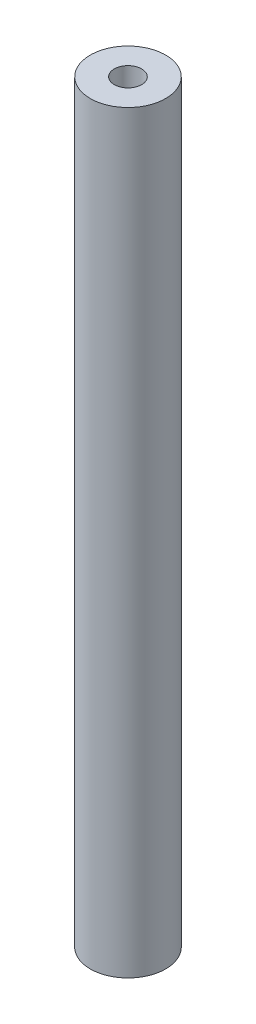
ISO-10303-21;
HEADER;
FILE_DESCRIPTION(('STEP AP214'),'2;1');
FILE_NAME('part.step','',(''),(''),'','','');
FILE_SCHEMA(('AUTOMOTIVE_DESIGN { 1 0 10303 214 1 1 1 1 }'));
ENDSEC;
DATA;
#1=APPLICATION_CONTEXT('core data for automotive mechanical design processes');
#2=APPLICATION_PROTOCOL_DEFINITION('international standard','automotive_design',2000,#1);
#3=PRODUCT_CONTEXT('',#1,'mechanical');
#4=PRODUCT('Part','Part','',(#3));
#5=PRODUCT_RELATED_PRODUCT_CATEGORY('part','',(#4));
#6=PRODUCT_DEFINITION_FORMATION('','',#4);
#7=PRODUCT_DEFINITION_CONTEXT('part definition',#1,'design');
#8=PRODUCT_DEFINITION('design','',#6,#7);
#9=PRODUCT_DEFINITION_SHAPE('','',#8);
#10=(LENGTH_UNIT() NAMED_UNIT(*) SI_UNIT(.MILLI.,.METRE.));
#11=(NAMED_UNIT(*) PLANE_ANGLE_UNIT() SI_UNIT($,.RADIAN.));
#12=(NAMED_UNIT(*) SI_UNIT($,.STERADIAN.) SOLID_ANGLE_UNIT());
#13=UNCERTAINTY_MEASURE_WITH_UNIT(LENGTH_MEASURE(1.E-05),#10,'distance_accuracy_value','');
#14=(GEOMETRIC_REPRESENTATION_CONTEXT(3) GLOBAL_UNCERTAINTY_ASSIGNED_CONTEXT((#13)) GLOBAL_UNIT_ASSIGNED_CONTEXT((#10,
#11,#12)) REPRESENTATION_CONTEXT('',''));
#15=CARTESIAN_POINT('',(0.,0.,0.));
#16=DIRECTION('',(0.,0.,1.));
#17=DIRECTION('',(1.,0.,0.));
#18=AXIS2_PLACEMENT_3D('',#15,#16,#17);
#19=CARTESIAN_POINT('',(0.,95.25,4.16333634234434E-13));
#20=DIRECTION('',(0.,-1.,0.));
#21=DIRECTION('',(0.,0.,-1.));
#22=AXIS2_PLACEMENT_3D('',#19,#20,#21);
#23=CYLINDRICAL_SURFACE('',#22,4.7625);
#24=CARTESIAN_POINT('',(0.,95.25,4.16333634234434E-13));
#25=DIRECTION('',(0.,1.,0.));
#26=DIRECTION('',(0.,0.,1.));
#27=AXIS2_PLACEMENT_3D('',#24,#25,#26);
#28=CIRCLE('',#27,4.7625);
#29=CARTESIAN_POINT('',(0.,95.25,4.76250000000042));
#30=VERTEX_POINT('',#29);
#31=EDGE_CURVE('E11',#30,#30,#28,.T.);
#32=ORIENTED_EDGE('',*,*,#31,.F.);
#33=EDGE_LOOP('',(#32));
#34=FACE_BOUND('',#33,.T.);
#35=CARTESIAN_POINT('',(0.,0.,0.));
#36=DIRECTION('',(0.,1.,0.));
#37=DIRECTION('',(0.,0.,1.));
#38=AXIS2_PLACEMENT_3D('',#35,#36,#37);
#39=CIRCLE('',#38,4.7625);
#40=CARTESIAN_POINT('',(0.,0.,4.7625));
#41=VERTEX_POINT('',#40);
#42=EDGE_CURVE('E43',#41,#41,#39,.T.);
#43=ORIENTED_EDGE('',*,*,#42,.T.);
#44=EDGE_LOOP('',(#43));
#45=FACE_BOUND('',#44,.T.);
#46=ADVANCED_FACE('F40',(#34,#45),#23,.T.);
#47=CARTESIAN_POINT('',(0.,95.25,4.16333634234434E-13));
#48=DIRECTION('',(0.,1.,0.));
#49=DIRECTION('',(0.,0.,1.));
#50=AXIS2_PLACEMENT_3D('',#47,#48,#49);
#51=PLANE('',#50);
#52=CARTESIAN_POINT('',(0.,95.25,4.16333634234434E-13));
#53=DIRECTION('',(0.,1.,0.));
#54=DIRECTION('',(0.,0.,1.));
#55=AXIS2_PLACEMENT_3D('',#52,#53,#54);
#56=CIRCLE('',#55,1.72719999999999);
#57=CARTESIAN_POINT('',(0.,95.25,1.72720000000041));
#58=VERTEX_POINT('',#57);
#59=EDGE_CURVE('E64',#58,#58,#56,.T.);
#60=ORIENTED_EDGE('',*,*,#59,.F.);
#61=EDGE_LOOP('',(#60));
#62=FACE_BOUND('',#61,.T.);
#63=ORIENTED_EDGE('',*,*,#31,.T.);
#64=EDGE_LOOP('',(#63));
#65=FACE_BOUND('',#64,.T.);
#66=ADVANCED_FACE('F82',(#62,#65),#51,.T.);
#67=CARTESIAN_POINT('',(0.,0.,0.));
#68=DIRECTION('',(0.,1.,0.));
#69=DIRECTION('',(0.,0.,1.));
#70=AXIS2_PLACEMENT_3D('',#67,#68,#69);
#71=PLANE('',#70);
#72=CARTESIAN_POINT('',(0.,0.,0.));
#73=DIRECTION('',(0.,-1.,0.));
#74=DIRECTION('',(0.,0.,-1.));
#75=AXIS2_PLACEMENT_3D('',#72,#73,#74);
#76=CIRCLE('',#75,1.72719999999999);
#77=CARTESIAN_POINT('',(0.,0.,-1.72719999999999));
#78=VERTEX_POINT('',#77);
#79=EDGE_CURVE('E63',#78,#78,#76,.T.);
#80=ORIENTED_EDGE('',*,*,#79,.F.);
#81=EDGE_LOOP('',(#80));
#82=FACE_BOUND('',#81,.T.);
#83=ORIENTED_EDGE('',*,*,#42,.F.);
#84=EDGE_LOOP('',(#83));
#85=FACE_BOUND('',#84,.T.);
#86=ADVANCED_FACE('F79',(#82,#85),#71,.F.);
#87=CARTESIAN_POINT('',(0.,21.4376000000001,1.38777878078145E-13));
#88=DIRECTION('',(0.,-1.,0.));
#89=DIRECTION('',(0.,0.,-1.));
#90=AXIS2_PLACEMENT_3D('',#87,#88,#89);
#91=CONICAL_SURFACE('',#90,1.72719999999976,1.02974425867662);
#92=CARTESIAN_POINT('',(0.,22.4754064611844,1.38777878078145E-13));
#93=VERTEX_POINT('',#92);
#94=VERTEX_LOOP('',#93);
#95=FACE_BOUND('',#94,.T.);
#96=CARTESIAN_POINT('',(0.,21.4376000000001,1.38777878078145E-13));
#97=DIRECTION('',(0.,-1.,0.));
#98=DIRECTION('',(0.,0.,-1.));
#99=AXIS2_PLACEMENT_3D('',#96,#97,#98);
#100=CIRCLE('',#99,1.72719999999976);
#101=CARTESIAN_POINT('',(0.,21.4376,-1.72719999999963));
#102=VERTEX_POINT('',#101);
#103=EDGE_CURVE('E67',#102,#102,#100,.T.);
#104=ORIENTED_EDGE('',*,*,#103,.T.);
#105=EDGE_LOOP('',(#104));
#106=FACE_BOUND('',#105,.T.);
#107=ADVANCED_FACE('F81',(#95,#106),#91,.F.);
#108=CARTESIAN_POINT('',(0.,0.,0.));
#109=DIRECTION('',(0.,-1.,0.));
#110=DIRECTION('',(0.,0.,-1.));
#111=AXIS2_PLACEMENT_3D('',#108,#109,#110);
#112=CYLINDRICAL_SURFACE('',#111,1.72719999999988);
#113=ORIENTED_EDGE('',*,*,#103,.F.);
#114=EDGE_LOOP('',(#113));
#115=FACE_BOUND('',#114,.T.);
#116=ORIENTED_EDGE('',*,*,#79,.T.);
#117=EDGE_LOOP('',(#116));
#118=FACE_BOUND('',#117,.T.);
#119=ADVANCED_FACE('F57',(#115,#118),#112,.F.);
#120=CARTESIAN_POINT('',(0.,73.8124,3.46944695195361E-13));
#121=DIRECTION('',(0.,1.,0.));
#122=DIRECTION('',(0.,0.,1.));
#123=AXIS2_PLACEMENT_3D('',#120,#121,#122);
#124=CONICAL_SURFACE('',#123,1.72719999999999,1.02974425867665);
#125=CARTESIAN_POINT('',(0.,72.7745935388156,3.46944695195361E-13));
#126=VERTEX_POINT('',#125);
#127=VERTEX_LOOP('',#126);
#128=FACE_BOUND('',#127,.T.);
#129=CARTESIAN_POINT('',(0.,73.8124,3.46944695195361E-13));
#130=DIRECTION('',(0.,1.,0.));
#131=DIRECTION('',(0.,0.,1.));
#132=AXIS2_PLACEMENT_3D('',#129,#130,#131);
#133=CIRCLE('',#132,1.72719999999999);
#134=CARTESIAN_POINT('',(0.,73.8124,1.72720000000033));
#135=VERTEX_POINT('',#134);
#136=EDGE_CURVE('E61',#135,#135,#133,.T.);
#137=ORIENTED_EDGE('',*,*,#136,.T.);
#138=EDGE_LOOP('',(#137));
#139=FACE_BOUND('',#138,.T.);
#140=ADVANCED_FACE('F53',(#128,#139),#124,.F.);
#141=CARTESIAN_POINT('',(0.,95.25,4.16333634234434E-13));
#142=DIRECTION('',(0.,1.,0.));
#143=DIRECTION('',(0.,0.,1.));
#144=AXIS2_PLACEMENT_3D('',#141,#142,#143);
#145=CYLINDRICAL_SURFACE('',#144,1.72719999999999);
#146=ORIENTED_EDGE('',*,*,#136,.F.);
#147=EDGE_LOOP('',(#146));
#148=FACE_BOUND('',#147,.T.);
#149=ORIENTED_EDGE('',*,*,#59,.T.);
#150=EDGE_LOOP('',(#149));
#151=FACE_BOUND('',#150,.T.);
#152=ADVANCED_FACE('F56',(#148,#151),#145,.F.);
#153=CLOSED_SHELL('',(#46,#66,#86,#107,#119,#140,#152));
#154=MANIFOLD_SOLID_BREP('B2',#153);
#155=ADVANCED_BREP_SHAPE_REPRESENTATION('',(#18,#154),#14);
#156=SHAPE_DEFINITION_REPRESENTATION(#9,#155);
ENDSEC;
END-ISO-10303-21;
